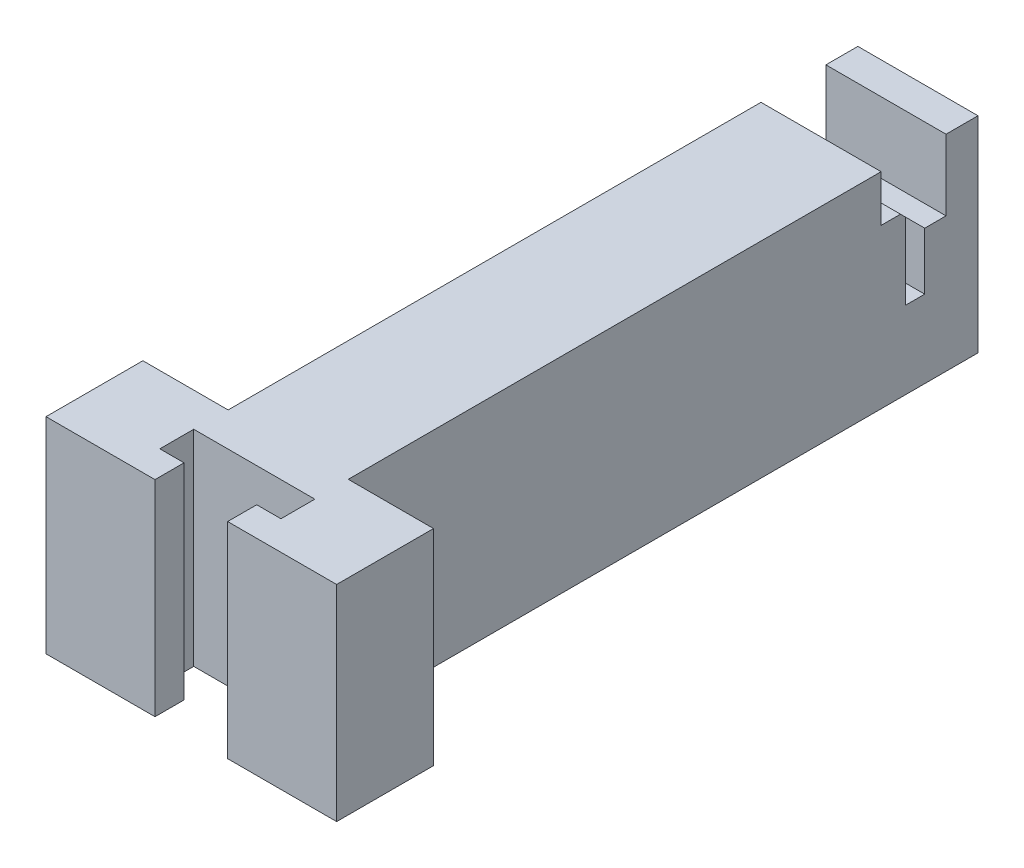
from build123d import *

# Parameters (mm, degrees)
SKETCH_1_W          = 30
SKETCH_1_H          = 21.2
EXTRUDE_1_DEPTH     = 75
SKETCH_2_OUTSIDE_W  = 93.702
SKETCH_2_OUTSIDE_H  = 39.902
CUT_EXTRUDE_1_DEPTH = 75
SKETCH_4_OUTSIDE_W  = 48.702
SKETCH_4_OUTSIDE_H  = 93.702
CUT_EXTRUDE_3_DEPTH = 75


with BuildPart() as part:
    # Sketch 1 → Extrude 1 (new body)
    with BuildSketch(Plane.XY):
        with Locations((15, 10.6)):
            Rectangle(SKETCH_1_W, SKETCH_1_H)
    extrude(amount=EXTRUDE_1_DEPTH)

    # Sketch 2 outside → Cut-Extrude 1 (cut)
    with BuildSketch(Plane(origin=(30, 0, 0), x_dir=(0, 0, -1), z_dir=(1, 0, 0))):
        with Locations((-37.5, 10.6)):
            Rectangle(SKETCH_2_OUTSIDE_W, SKETCH_2_OUTSIDE_H)
        Polygon((-8, 16.4), (-7.5, 15.9), (-7.5, 8), (-5.5, 8), (-5.5, 13.9), (-3.3, 13.9), (-3.3, 21.2), (0, 21.2), (0, 0), (-75, 0), (-75, 21.2), (-10, 21.2), (-10, 16.4), align=None, mode=Mode.SUBTRACT)
    extrude(amount=-CUT_EXTRUDE_1_DEPTH, mode=Mode.SUBTRACT)

    # Sketch 4 outside → Cut-Extrude 3 (cut)
    with BuildSketch(Plane(origin=(0, 21.2, 0), x_dir=(1, 0, 0), z_dir=(0, 1, 0))):
        with Locations((15, -37.5)):
            Rectangle(SKETCH_4_OUTSIDE_W, SKETCH_4_OUTSIDE_H)
        Polygon((8.8, -65), (8.8, 0), (21.2, 0), (21.2, -65), (30, -65), (30, -75), (18.75, -75), (18.75, -72), (21.25, -72), (21.25, -68.5), (8.75, -68.5), (8.75, -72), (11.25, -72), (11.25, -75), (0, -75), (0, -65), align=None, mode=Mode.SUBTRACT)
    extrude(amount=-CUT_EXTRUDE_3_DEPTH, mode=Mode.SUBTRACT)


solid = part.part
